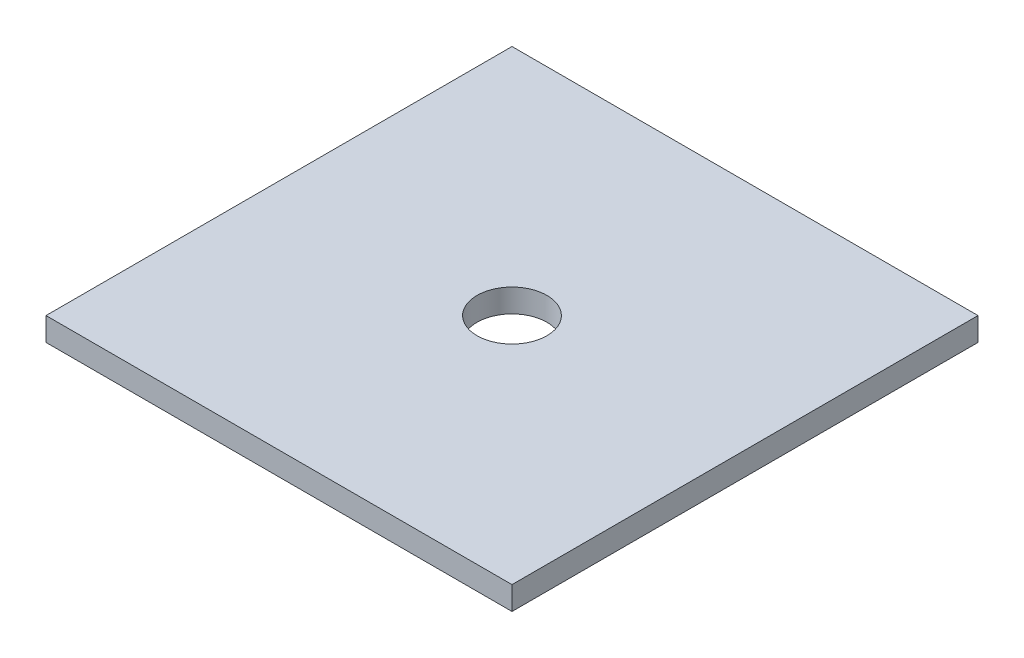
ISO-10303-21;
HEADER;
FILE_DESCRIPTION(('STEP AP214'),'2;1');
FILE_NAME('part.step','',(''),(''),'','','');
FILE_SCHEMA(('AUTOMOTIVE_DESIGN { 1 0 10303 214 1 1 1 1 }'));
ENDSEC;
DATA;
#1=APPLICATION_CONTEXT('core data for automotive mechanical design processes');
#2=APPLICATION_PROTOCOL_DEFINITION('international standard','automotive_design',2000,#1);
#3=PRODUCT_CONTEXT('',#1,'mechanical');
#4=PRODUCT('Part','Part','',(#3));
#5=PRODUCT_RELATED_PRODUCT_CATEGORY('part','',(#4));
#6=PRODUCT_DEFINITION_FORMATION('','',#4);
#7=PRODUCT_DEFINITION_CONTEXT('part definition',#1,'design');
#8=PRODUCT_DEFINITION('design','',#6,#7);
#9=PRODUCT_DEFINITION_SHAPE('','',#8);
#10=(LENGTH_UNIT() NAMED_UNIT(*) SI_UNIT(.MILLI.,.METRE.));
#11=(NAMED_UNIT(*) PLANE_ANGLE_UNIT() SI_UNIT($,.RADIAN.));
#12=(NAMED_UNIT(*) SI_UNIT($,.STERADIAN.) SOLID_ANGLE_UNIT());
#13=UNCERTAINTY_MEASURE_WITH_UNIT(LENGTH_MEASURE(1.E-05),#10,'distance_accuracy_value','');
#14=(GEOMETRIC_REPRESENTATION_CONTEXT(3) GLOBAL_UNCERTAINTY_ASSIGNED_CONTEXT((#13)) GLOBAL_UNIT_ASSIGNED_CONTEXT((#10,
#11,#12)) REPRESENTATION_CONTEXT('',''));
#15=CARTESIAN_POINT('',(0.,0.,0.));
#16=DIRECTION('',(0.,0.,1.));
#17=DIRECTION('',(1.,0.,0.));
#18=AXIS2_PLACEMENT_3D('',#15,#16,#17);
#19=CARTESIAN_POINT('',(0.,3.,-60.));
#20=DIRECTION('',(0.,-1.,0.));
#21=DIRECTION('',(0.,0.,-1.));
#22=AXIS2_PLACEMENT_3D('',#19,#20,#21);
#23=PLANE('',#22);
#24=DIRECTION('',(0.,0.,1.));
#25=VECTOR('',#24,1.);
#26=CARTESIAN_POINT('',(0.,3.,0.));
#27=LINE('',#26,#25);
#28=CARTESIAN_POINT('',(0.,3.,-60.));
#29=VERTEX_POINT('',#28);
#30=CARTESIAN_POINT('',(0.,3.,0.));
#31=VERTEX_POINT('',#30);
#32=EDGE_CURVE('E83',#29,#31,#27,.T.);
#33=ORIENTED_EDGE('',*,*,#32,.T.);
#34=DIRECTION('',(1.,0.,0.));
#35=VECTOR('',#34,1.);
#36=CARTESIAN_POINT('',(0.,3.,0.));
#37=LINE('',#36,#35);
#38=CARTESIAN_POINT('',(60.,3.,0.));
#39=VERTEX_POINT('',#38);
#40=EDGE_CURVE('E78',#31,#39,#37,.T.);
#41=ORIENTED_EDGE('',*,*,#40,.T.);
#42=DIRECTION('',(0.,0.,-1.));
#43=VECTOR('',#42,1.);
#44=CARTESIAN_POINT('',(60.,3.,0.));
#45=LINE('',#44,#43);
#46=CARTESIAN_POINT('',(60.,3.,-60.));
#47=VERTEX_POINT('',#46);
#48=EDGE_CURVE('E81',#39,#47,#45,.T.);
#49=ORIENTED_EDGE('',*,*,#48,.T.);
#50=DIRECTION('',(-1.,0.,0.));
#51=VECTOR('',#50,1.);
#52=CARTESIAN_POINT('',(0.,3.,-60.));
#53=LINE('',#52,#51);
#54=EDGE_CURVE('E48',#47,#29,#53,.T.);
#55=ORIENTED_EDGE('',*,*,#54,.T.);
#56=EDGE_LOOP('',(#33,#41,#49,#55));
#57=FACE_BOUND('',#56,.T.);
#58=CARTESIAN_POINT('',(30.,3.,-30.));
#59=DIRECTION('',(0.,1.,0.));
#60=DIRECTION('',(0.,0.,1.));
#61=AXIS2_PLACEMENT_3D('',#58,#59,#60);
#62=CIRCLE('',#61,4.5);
#63=CARTESIAN_POINT('',(30.,3.,-25.5));
#64=VERTEX_POINT('',#63);
#65=EDGE_CURVE('E98',#64,#64,#62,.T.);
#66=ORIENTED_EDGE('',*,*,#65,.F.);
#67=EDGE_LOOP('',(#66));
#68=FACE_BOUND('',#67,.T.);
#69=ADVANCED_FACE('F31',(#57,#68),#23,.F.);
#70=CARTESIAN_POINT('',(0.,0.,-60.));
#71=DIRECTION('',(0.,-1.,0.));
#72=DIRECTION('',(0.,0.,-1.));
#73=AXIS2_PLACEMENT_3D('',#70,#71,#72);
#74=PLANE('',#73);
#75=DIRECTION('',(0.,0.,1.));
#76=VECTOR('',#75,1.);
#77=CARTESIAN_POINT('',(0.,0.,0.));
#78=LINE('',#77,#76);
#79=CARTESIAN_POINT('',(0.,0.,-60.));
#80=VERTEX_POINT('',#79);
#81=CARTESIAN_POINT('',(0.,0.,0.));
#82=VERTEX_POINT('',#81);
#83=EDGE_CURVE('E95',#80,#82,#78,.T.);
#84=ORIENTED_EDGE('',*,*,#83,.F.);
#85=DIRECTION('',(-1.,0.,0.));
#86=VECTOR('',#85,1.);
#87=CARTESIAN_POINT('',(0.,0.,-60.));
#88=LINE('',#87,#86);
#89=CARTESIAN_POINT('',(60.,0.,-60.));
#90=VERTEX_POINT('',#89);
#91=EDGE_CURVE('E71',#90,#80,#88,.T.);
#92=ORIENTED_EDGE('',*,*,#91,.F.);
#93=DIRECTION('',(0.,0.,-1.));
#94=VECTOR('',#93,1.);
#95=CARTESIAN_POINT('',(60.,0.,0.));
#96=LINE('',#95,#94);
#97=CARTESIAN_POINT('',(60.,0.,0.));
#98=VERTEX_POINT('',#97);
#99=EDGE_CURVE('E65',#98,#90,#96,.T.);
#100=ORIENTED_EDGE('',*,*,#99,.F.);
#101=DIRECTION('',(1.,0.,0.));
#102=VECTOR('',#101,1.);
#103=CARTESIAN_POINT('',(0.,0.,0.));
#104=LINE('',#103,#102);
#105=EDGE_CURVE('E87',#82,#98,#104,.T.);
#106=ORIENTED_EDGE('',*,*,#105,.F.);
#107=EDGE_LOOP('',(#84,#92,#100,#106));
#108=FACE_BOUND('',#107,.T.);
#109=CARTESIAN_POINT('',(30.,0.,-30.));
#110=DIRECTION('',(0.,1.,0.));
#111=DIRECTION('',(0.,0.,1.));
#112=AXIS2_PLACEMENT_3D('',#109,#110,#111);
#113=CIRCLE('',#112,4.5);
#114=CARTESIAN_POINT('',(30.,0.,-25.5));
#115=VERTEX_POINT('',#114);
#116=EDGE_CURVE('E110',#115,#115,#113,.T.);
#117=ORIENTED_EDGE('',*,*,#116,.T.);
#118=EDGE_LOOP('',(#117));
#119=FACE_BOUND('',#118,.T.);
#120=ADVANCED_FACE('F106',(#108,#119),#74,.T.);
#121=CARTESIAN_POINT('',(0.,3.,0.));
#122=DIRECTION('',(1.,0.,0.));
#123=DIRECTION('',(0.,0.,-1.));
#124=AXIS2_PLACEMENT_3D('',#121,#122,#123);
#125=PLANE('',#124);
#126=ORIENTED_EDGE('',*,*,#83,.T.);
#127=DIRECTION('',(0.,-1.,0.));
#128=VECTOR('',#127,1.);
#129=CARTESIAN_POINT('',(0.,3.,0.));
#130=LINE('',#129,#128);
#131=EDGE_CURVE('E11',#31,#82,#130,.T.);
#132=ORIENTED_EDGE('',*,*,#131,.F.);
#133=ORIENTED_EDGE('',*,*,#32,.F.);
#134=DIRECTION('',(0.,-1.,0.));
#135=VECTOR('',#134,1.);
#136=CARTESIAN_POINT('',(0.,3.,-60.));
#137=LINE('',#136,#135);
#138=EDGE_CURVE('E91',#29,#80,#137,.T.);
#139=ORIENTED_EDGE('',*,*,#138,.T.);
#140=EDGE_LOOP('',(#126,#132,#133,#139));
#141=FACE_BOUND('',#140,.T.);
#142=ADVANCED_FACE('F33',(#141),#125,.F.);
#143=CARTESIAN_POINT('',(0.,3.,0.));
#144=DIRECTION('',(0.,0.,-1.));
#145=DIRECTION('',(-1.,0.,0.));
#146=AXIS2_PLACEMENT_3D('',#143,#144,#145);
#147=PLANE('',#146);
#148=ORIENTED_EDGE('',*,*,#105,.T.);
#149=DIRECTION('',(0.,-1.,0.));
#150=VECTOR('',#149,1.);
#151=CARTESIAN_POINT('',(60.,3.,0.));
#152=LINE('',#151,#150);
#153=EDGE_CURVE('E40',#39,#98,#152,.T.);
#154=ORIENTED_EDGE('',*,*,#153,.F.);
#155=ORIENTED_EDGE('',*,*,#40,.F.);
#156=ORIENTED_EDGE('',*,*,#131,.T.);
#157=EDGE_LOOP('',(#148,#154,#155,#156));
#158=FACE_BOUND('',#157,.T.);
#159=ADVANCED_FACE('F86',(#158),#147,.F.);
#160=CARTESIAN_POINT('',(60.,3.,0.));
#161=DIRECTION('',(-1.,0.,0.));
#162=DIRECTION('',(0.,0.,1.));
#163=AXIS2_PLACEMENT_3D('',#160,#161,#162);
#164=PLANE('',#163);
#165=ORIENTED_EDGE('',*,*,#99,.T.);
#166=DIRECTION('',(0.,-1.,0.));
#167=VECTOR('',#166,1.);
#168=CARTESIAN_POINT('',(60.,3.,-60.));
#169=LINE('',#168,#167);
#170=EDGE_CURVE('E88',#47,#90,#169,.T.);
#171=ORIENTED_EDGE('',*,*,#170,.F.);
#172=ORIENTED_EDGE('',*,*,#48,.F.);
#173=ORIENTED_EDGE('',*,*,#153,.T.);
#174=EDGE_LOOP('',(#165,#171,#172,#173));
#175=FACE_BOUND('',#174,.T.);
#176=ADVANCED_FACE('F89',(#175),#164,.F.);
#177=CARTESIAN_POINT('',(0.,3.,-60.));
#178=DIRECTION('',(0.,0.,1.));
#179=DIRECTION('',(1.,0.,0.));
#180=AXIS2_PLACEMENT_3D('',#177,#178,#179);
#181=PLANE('',#180);
#182=ORIENTED_EDGE('',*,*,#91,.T.);
#183=ORIENTED_EDGE('',*,*,#138,.F.);
#184=ORIENTED_EDGE('',*,*,#54,.F.);
#185=ORIENTED_EDGE('',*,*,#170,.T.);
#186=EDGE_LOOP('',(#182,#183,#184,#185));
#187=FACE_BOUND('',#186,.T.);
#188=ADVANCED_FACE('F103',(#187),#181,.F.);
#189=CARTESIAN_POINT('',(30.,3.,-30.));
#190=DIRECTION('',(0.,-1.,0.));
#191=DIRECTION('',(0.,0.,-1.));
#192=AXIS2_PLACEMENT_3D('',#189,#190,#191);
#193=CYLINDRICAL_SURFACE('',#192,4.5);
#194=ORIENTED_EDGE('',*,*,#65,.T.);
#195=EDGE_LOOP('',(#194));
#196=FACE_BOUND('',#195,.T.);
#197=ORIENTED_EDGE('',*,*,#116,.F.);
#198=EDGE_LOOP('',(#197));
#199=FACE_BOUND('',#198,.T.);
#200=ADVANCED_FACE('F116',(#196,#199),#193,.F.);
#201=CLOSED_SHELL('',(#69,#120,#142,#159,#176,#188,#200));
#202=MANIFOLD_SOLID_BREP('B2',#201);
#203=ADVANCED_BREP_SHAPE_REPRESENTATION('',(#18,#202),#14);
#204=SHAPE_DEFINITION_REPRESENTATION(#9,#203);
ENDSEC;
END-ISO-10303-21;
